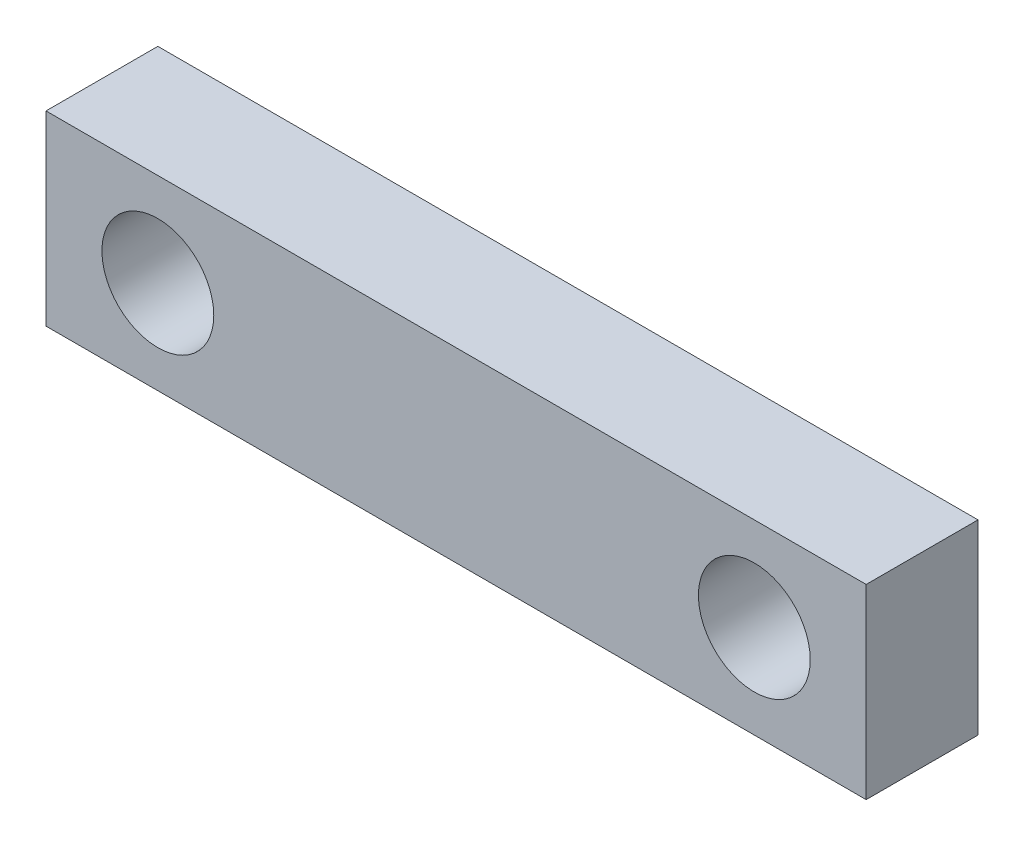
from build123d import *

# Parameters (mm, degrees)
ESQUISSE1_W             = 110
ESQUISSE1_H             = 25
BASE_EXTRUSION_DEPTH    = 15
ESQUISSE2_R             = 7.5
ENL_V_MAT_EXTRU_1_DEPTH = 114.798066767


with BuildPart() as part:
    # Esquisse1 → Base-Extrusion (new body)
    with BuildSketch(Plane.XY):
        with Locations((55, 12.5)):
            Rectangle(ESQUISSE1_W, ESQUISSE1_H)
    extrude(amount=BASE_EXTRUSION_DEPTH)

    # Esquisse2 → Enl_v. mat.-Extru.1 (cut, through all)
    with BuildSketch(Plane.XY.offset(15)):
        with Locations((15, 12.5)):
            Circle(ESQUISSE2_R)
        with Locations((95, 12.5)):
            Circle(ESQUISSE2_R)
    extrude(amount=-ENL_V_MAT_EXTRU_1_DEPTH, mode=Mode.SUBTRACT)


solid = part.part
